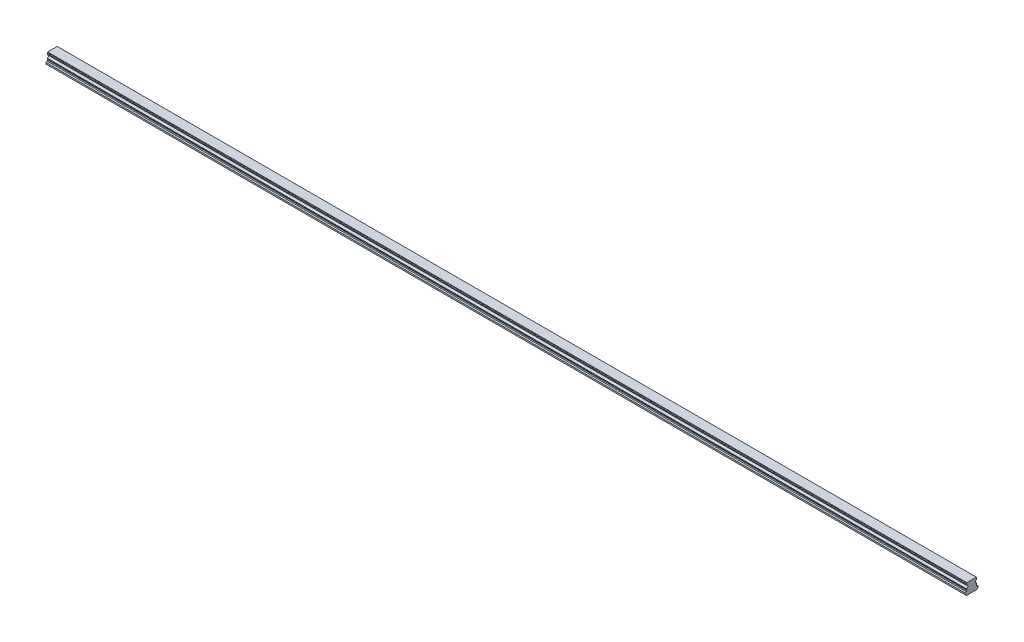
from build123d import *

# Parameters (mm, degrees)
BOSS_EXTRUDE1_DEPTH        = 1800
SKETCH3_R                  = 3
SKETCH3_R_2                = 2.5
CUT_EXTRUDE3_DEPTH         = 12
SKETCH3_2_R                = 2.5
CUT_EXTRUDE4_DEPTH         = 15
CHAMFER1_SIZE              = 0.5
LPATTERN4_COUNT            = 30
LPATTERN4_PITCH            = 60
CHAMFER1_OF_LPATTERN4_SIZE = 0.5


with BuildPart() as part:
    # Sketch1 → Boss-Extrude1 (new body)
    with BuildSketch(Plane(origin=(0, 0, 0), x_dir=(0, 0, -1), z_dir=(1, 0, 0))):
        with BuildLine():
            Line((9.375, 21.8), (-9.375, 21.8))
            Line((-9.375, 21.8), (-9.375, 20.756))
            Line((-9.375, 20.756), (-10, 19.415683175))
            Line((-10, 19.415683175), (-10, 17.685449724))
            ThreePointArc((-10, 17.685449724), (-7.2, 14.6), (-10, 11.514550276))
            Line((-10, 11.514550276), (-10, 9.784316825))
            Line((-10, 9.784316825), (-9.375, 8.444))
            Line((-9.375, 8.444), (-9.922688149, 6.4))
            Line((-9.922688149, 6.4), (-12.5, 5.489338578))
            Line((-12.5, 5.489338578), (-12.5, 2.65))
            Line((-12.5, 2.65), (-9.85, 0))
            Line((-9.85, 0), (-5.5, 0))
            Line((-5.5, 0), (-5, 0.5))
            Line((-5, 0.5), (5, 0.5))
            Line((5, 0.5), (5.5, 0))
            Line((5.5, 0), (9.85, 0))
            Line((9.85, 0), (12.5, 2.65))
            Line((12.5, 2.65), (12.5, 5.489338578))
            Line((12.5, 5.489338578), (9.922688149, 6.4))
            Line((9.922688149, 6.4), (9.375, 8.444))
            Line((9.375, 8.444), (10, 9.784316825))
            Line((10, 9.784316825), (10, 11.514550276))
            ThreePointArc((10, 11.514550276), (7.2, 14.6), (10, 17.685449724))
            Line((10, 17.685449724), (10, 19.415683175))
            Line((10, 19.415683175), (9.375, 20.756))
            Line((9.375, 20.756), (9.375, 21.8))
        make_face()
    extrude(amount=BOSS_EXTRUDE1_DEPTH)

    # Sketch3 → Cut-Extrude3 (cut)
    with BuildSketch(Plane.XZ):
        with Locations(Location((30, 0, 0), (0, 0, 270))):
            Circle(SKETCH3_R)
        with Locations(Location((30, 0, 0), (0, 0, 270))):
            Circle(SKETCH3_R_2, mode=Mode.SUBTRACT)
    cut_extrude3 = extrude(amount=-CUT_EXTRUDE3_DEPTH, mode=Mode.SUBTRACT)

    # Sketch3_2 → Cut-Extrude4 (cut)
    with BuildSketch(Plane.XZ):
        with Locations(Location((30, 0, 0), (0, 0, 270))):
            Circle(SKETCH3_2_R)
    cut_extrude4 = extrude(amount=-CUT_EXTRUDE4_DEPTH, mode=Mode.SUBTRACT)

    # Cut-Extrude5 cone 1 section (on through the dimple's axis) → Cut-Extrude5 (revolve, cut)
    with BuildSketch(Plane(origin=(30, 15, 0), x_dir=(0, 0, -1), z_dir=(1, 0, 0))):
        Polygon((0, 0), (2.5, 0), (0, 1.443375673), align=None)
    cut_extrude5 = revolve(axis=Axis((30, 15, 0), (0, 1, 0)), mode=Mode.SUBTRACT)

    # Chamfer1
    chamfer1_edges = [part.edges().sort_by_distance(p)[0] for p in [
        (30, 0.5, 3),
    ]]
    chamfer(chamfer1_edges, length=CHAMFER1_SIZE)

    # LPattern4: Cut-Extrude3, Cut-Extrude4, Cut-Extrude5 ×30
    with Locations(*[(i * LPATTERN4_PITCH, 0, 0) for i in range(1, LPATTERN4_COUNT)]):
        add(cut_extrude3, mode=Mode.SUBTRACT)
        add(cut_extrude4, mode=Mode.SUBTRACT)
        add(cut_extrude5, mode=Mode.SUBTRACT)

    # Chamfer1 of LPattern4
    chamfer1_of_lpattern4_edges = [part.edges().sort_by_distance(p)[0] for p in [
        (90, 0.5, 3),
        (150, 0.5, 3),
        (210, 0.5, 3),
        (270, 0.5, 3),
        (330, 0.5, 3),
        (390, 0.5, 3),
        (450, 0.5, 3),
        (510, 0.5, 3),
        (570, 0.5, 3),
        (630, 0.5, 3),
        (690, 0.5, 3),
        (750, 0.5, 3),
        (810, 0.5, 3),
        (870, 0.5, 3),
        (930, 0.5, 3),
        (990, 0.5, 3),
        (1050, 0.5, 3),
        (1110, 0.5, 3),
        (1170, 0.5, 3),
        (1230, 0.5, 3),
        (1290, 0.5, 3),
        (1350, 0.5, 3),
        (1410, 0.5, 3),
        (1470, 0.5, 3),
        (1530, 0.5, 3),
        (1590, 0.5, 3),
        (1650, 0.5, 3),
        (1710, 0.5, 3),
        (1770, 0.5, 3),
    ]]
    chamfer(chamfer1_of_lpattern4_edges, length=CHAMFER1_OF_LPATTERN4_SIZE)


solid = part.part
